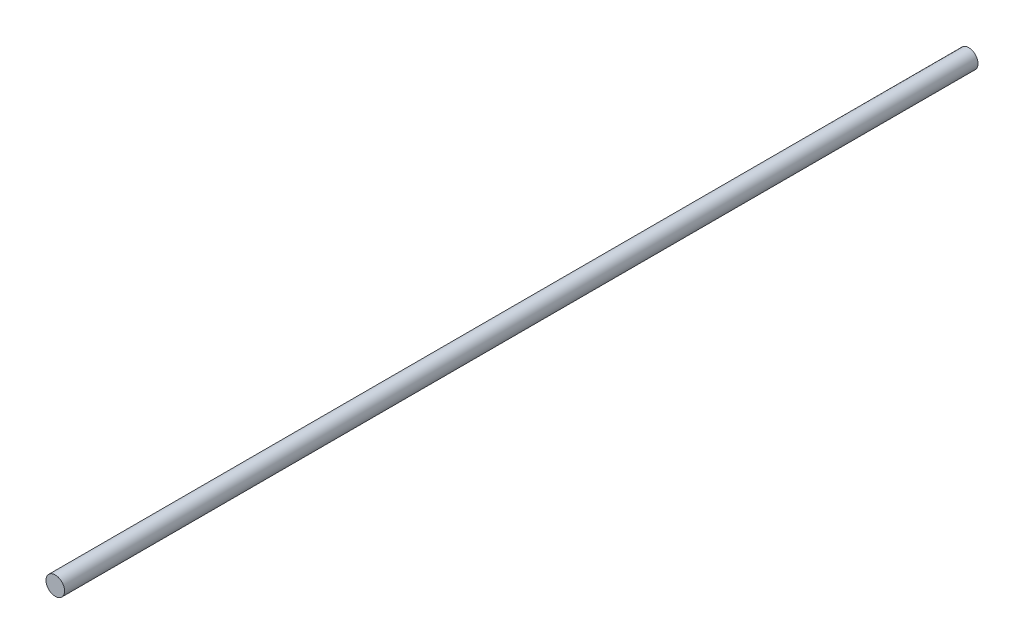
from build123d import *

# Parameters (mm, degrees)
SKETCH1_R           = 30
BOSS_EXTRUDE1_DEPTH = 2950


with BuildPart() as part:
    # Sketch1 → Boss-Extrude1 (new body)
    with BuildSketch(Plane.XY):
        Circle(SKETCH1_R)
    extrude(amount=-BOSS_EXTRUDE1_DEPTH)


solid = part.part
